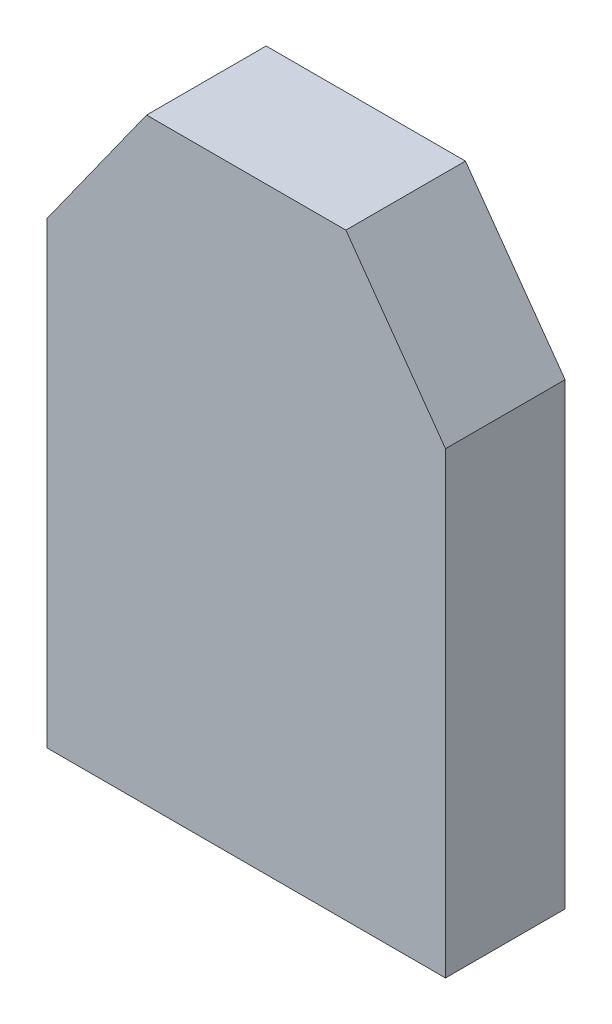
from build123d import *

# Parameters (mm, degrees)
EXTRUDE_1_DEPTH = 12


with BuildPart() as part:
    # Sketch 1 → Extrude 1 (new body)
    with BuildSketch(Plane.XY):
        Polygon((10, 60), (-10, 60), (-20, 46), (-20, 0), (20, 0), (20, 46), align=None)
    extrude(amount=EXTRUDE_1_DEPTH)


solid = part.part
